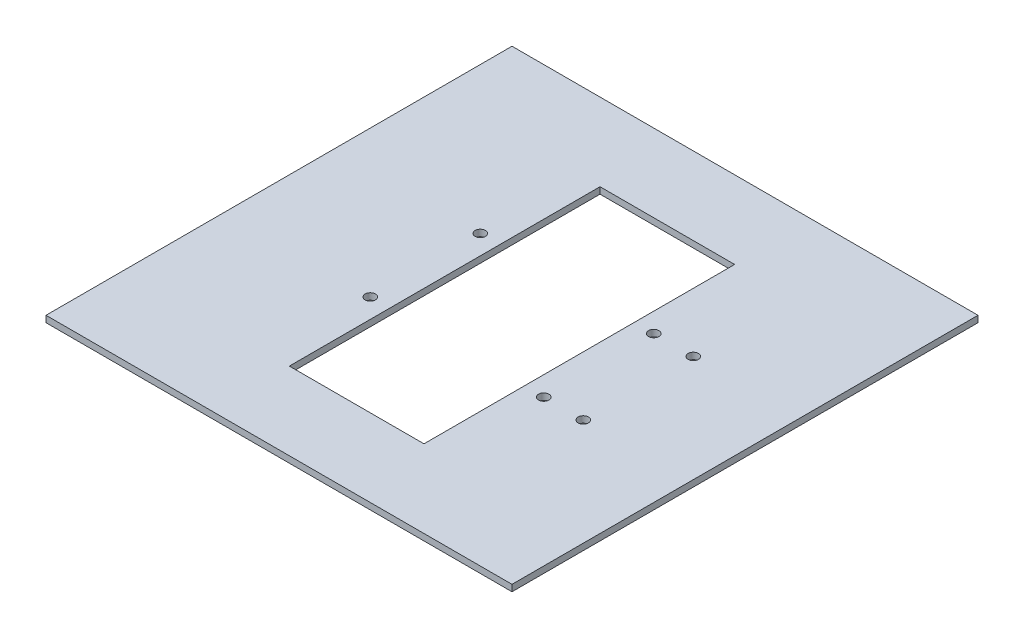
ISO-10303-21;
HEADER;
FILE_DESCRIPTION(('STEP AP214'),'2;1');
FILE_NAME('part.step','',(''),(''),'','','');
FILE_SCHEMA(('AUTOMOTIVE_DESIGN { 1 0 10303 214 1 1 1 1 }'));
ENDSEC;
DATA;
#1=APPLICATION_CONTEXT('core data for automotive mechanical design processes');
#2=APPLICATION_PROTOCOL_DEFINITION('international standard','automotive_design',2000,#1);
#3=PRODUCT_CONTEXT('',#1,'mechanical');
#4=PRODUCT('Part','Part','',(#3));
#5=PRODUCT_RELATED_PRODUCT_CATEGORY('part','',(#4));
#6=PRODUCT_DEFINITION_FORMATION('','',#4);
#7=PRODUCT_DEFINITION_CONTEXT('part definition',#1,'design');
#8=PRODUCT_DEFINITION('design','',#6,#7);
#9=PRODUCT_DEFINITION_SHAPE('','',#8);
#10=(LENGTH_UNIT() NAMED_UNIT(*) SI_UNIT(.MILLI.,.METRE.));
#11=(NAMED_UNIT(*) PLANE_ANGLE_UNIT() SI_UNIT($,.RADIAN.));
#12=(NAMED_UNIT(*) SI_UNIT($,.STERADIAN.) SOLID_ANGLE_UNIT());
#13=UNCERTAINTY_MEASURE_WITH_UNIT(LENGTH_MEASURE(1.E-05),#10,'distance_accuracy_value','');
#14=(GEOMETRIC_REPRESENTATION_CONTEXT(3) GLOBAL_UNCERTAINTY_ASSIGNED_CONTEXT((#13)) GLOBAL_UNIT_ASSIGNED_CONTEXT((#10,
#11,#12)) REPRESENTATION_CONTEXT('',''));
#15=CARTESIAN_POINT('',(0.,0.,0.));
#16=DIRECTION('',(0.,0.,1.));
#17=DIRECTION('',(1.,0.,0.));
#18=AXIS2_PLACEMENT_3D('',#15,#16,#17);
#19=CARTESIAN_POINT('',(114.3,1.5875,-114.3));
#20=DIRECTION('',(-1.,0.,0.));
#21=DIRECTION('',(0.,0.,1.));
#22=AXIS2_PLACEMENT_3D('',#19,#20,#21);
#23=PLANE('',#22);
#24=DIRECTION('',(0.,0.,-1.));
#25=VECTOR('',#24,1.);
#26=CARTESIAN_POINT('',(114.3,-1.5875,-114.3));
#27=LINE('',#26,#25);
#28=CARTESIAN_POINT('',(114.3,-1.5875,114.3));
#29=VERTEX_POINT('',#28);
#30=CARTESIAN_POINT('',(114.3,-1.5875,-114.3));
#31=VERTEX_POINT('',#30);
#32=EDGE_CURVE('E166',#29,#31,#27,.T.);
#33=ORIENTED_EDGE('',*,*,#32,.T.);
#34=DIRECTION('',(0.,-1.,0.));
#35=VECTOR('',#34,1.);
#36=CARTESIAN_POINT('',(114.3,1.5875,-114.3));
#37=LINE('',#36,#35);
#38=CARTESIAN_POINT('',(114.3,1.5875,-114.3));
#39=VERTEX_POINT('',#38);
#40=EDGE_CURVE('E11',#39,#31,#37,.T.);
#41=ORIENTED_EDGE('',*,*,#40,.F.);
#42=DIRECTION('',(0.,0.,-1.));
#43=VECTOR('',#42,1.);
#44=CARTESIAN_POINT('',(114.3,1.5875,-114.3));
#45=LINE('',#44,#43);
#46=CARTESIAN_POINT('',(114.3,1.5875,114.3));
#47=VERTEX_POINT('',#46);
#48=EDGE_CURVE('E169',#47,#39,#45,.T.);
#49=ORIENTED_EDGE('',*,*,#48,.F.);
#50=DIRECTION('',(0.,-1.,0.));
#51=VECTOR('',#50,1.);
#52=CARTESIAN_POINT('',(114.3,1.5875,114.3));
#53=LINE('',#52,#51);
#54=EDGE_CURVE('E179',#47,#29,#53,.T.);
#55=ORIENTED_EDGE('',*,*,#54,.T.);
#56=EDGE_LOOP('',(#33,#41,#49,#55));
#57=FACE_BOUND('',#56,.T.);
#58=ADVANCED_FACE('F32',(#57),#23,.F.);
#59=CARTESIAN_POINT('',(-114.3,1.5875,-114.3));
#60=DIRECTION('',(0.,0.,1.));
#61=DIRECTION('',(1.,0.,0.));
#62=AXIS2_PLACEMENT_3D('',#59,#60,#61);
#63=PLANE('',#62);
#64=DIRECTION('',(-1.,0.,0.));
#65=VECTOR('',#64,1.);
#66=CARTESIAN_POINT('',(-114.3,-1.5875,-114.3));
#67=LINE('',#66,#65);
#68=CARTESIAN_POINT('',(-114.3,-1.5875,-114.3));
#69=VERTEX_POINT('',#68);
#70=EDGE_CURVE('E182',#31,#69,#67,.T.);
#71=ORIENTED_EDGE('',*,*,#70,.T.);
#72=DIRECTION('',(0.,-1.,0.));
#73=VECTOR('',#72,1.);
#74=CARTESIAN_POINT('',(-114.3,1.5875,-114.3));
#75=LINE('',#74,#73);
#76=CARTESIAN_POINT('',(-114.3,1.5875,-114.3));
#77=VERTEX_POINT('',#76);
#78=EDGE_CURVE('E39',#77,#69,#75,.T.);
#79=ORIENTED_EDGE('',*,*,#78,.F.);
#80=DIRECTION('',(-1.,0.,0.));
#81=VECTOR('',#80,1.);
#82=CARTESIAN_POINT('',(-114.3,1.5875,-114.3));
#83=LINE('',#82,#81);
#84=EDGE_CURVE('E172',#39,#77,#83,.T.);
#85=ORIENTED_EDGE('',*,*,#84,.F.);
#86=ORIENTED_EDGE('',*,*,#40,.T.);
#87=EDGE_LOOP('',(#71,#79,#85,#86));
#88=FACE_BOUND('',#87,.T.);
#89=ADVANCED_FACE('F211',(#88),#63,.F.);
#90=CARTESIAN_POINT('',(-114.3,1.5875,-114.3));
#91=DIRECTION('',(1.,0.,0.));
#92=DIRECTION('',(0.,0.,-1.));
#93=AXIS2_PLACEMENT_3D('',#90,#91,#92);
#94=PLANE('',#93);
#95=DIRECTION('',(0.,0.,1.));
#96=VECTOR('',#95,1.);
#97=CARTESIAN_POINT('',(-114.3,-1.5875,-114.3));
#98=LINE('',#97,#96);
#99=CARTESIAN_POINT('',(-114.3,-1.5875,114.3));
#100=VERTEX_POINT('',#99);
#101=EDGE_CURVE('E184',#69,#100,#98,.T.);
#102=ORIENTED_EDGE('',*,*,#101,.T.);
#103=DIRECTION('',(0.,-1.,0.));
#104=VECTOR('',#103,1.);
#105=CARTESIAN_POINT('',(-114.3,1.5875,114.3));
#106=LINE('',#105,#104);
#107=CARTESIAN_POINT('',(-114.3,1.5875,114.3));
#108=VERTEX_POINT('',#107);
#109=EDGE_CURVE('E189',#108,#100,#106,.T.);
#110=ORIENTED_EDGE('',*,*,#109,.F.);
#111=DIRECTION('',(0.,0.,1.));
#112=VECTOR('',#111,1.);
#113=CARTESIAN_POINT('',(-114.3,1.5875,-114.3));
#114=LINE('',#113,#112);
#115=EDGE_CURVE('E175',#77,#108,#114,.T.);
#116=ORIENTED_EDGE('',*,*,#115,.F.);
#117=ORIENTED_EDGE('',*,*,#78,.T.);
#118=EDGE_LOOP('',(#102,#110,#116,#117));
#119=FACE_BOUND('',#118,.T.);
#120=ADVANCED_FACE('F196',(#119),#94,.F.);
#121=CARTESIAN_POINT('',(-114.3,1.5875,114.3));
#122=DIRECTION('',(0.,0.,-1.));
#123=DIRECTION('',(-1.,0.,0.));
#124=AXIS2_PLACEMENT_3D('',#121,#122,#123);
#125=PLANE('',#124);
#126=DIRECTION('',(1.,0.,0.));
#127=VECTOR('',#126,1.);
#128=CARTESIAN_POINT('',(-114.3,-1.5875,114.3));
#129=LINE('',#128,#127);
#130=EDGE_CURVE('E173',#100,#29,#129,.T.);
#131=ORIENTED_EDGE('',*,*,#130,.T.);
#132=ORIENTED_EDGE('',*,*,#54,.F.);
#133=DIRECTION('',(1.,0.,0.));
#134=VECTOR('',#133,1.);
#135=CARTESIAN_POINT('',(-114.3,1.5875,114.3));
#136=LINE('',#135,#134);
#137=EDGE_CURVE('E177',#108,#47,#136,.T.);
#138=ORIENTED_EDGE('',*,*,#137,.F.);
#139=ORIENTED_EDGE('',*,*,#109,.T.);
#140=EDGE_LOOP('',(#131,#132,#138,#139));
#141=FACE_BOUND('',#140,.T.);
#142=ADVANCED_FACE('F204',(#141),#125,.F.);
#143=CARTESIAN_POINT('',(114.3,1.5875,114.3));
#144=DIRECTION('',(0.,1.,0.));
#145=DIRECTION('',(0.,0.,1.));
#146=AXIS2_PLACEMENT_3D('',#143,#144,#145);
#147=PLANE('',#146);
#148=DIRECTION('',(0.,0.,-1.));
#149=VECTOR('',#148,1.);
#150=CARTESIAN_POINT('',(33.02,1.5875,-76.2));
#151=LINE('',#150,#149);
#152=CARTESIAN_POINT('',(33.02,1.5875,76.2));
#153=VERTEX_POINT('',#152);
#154=CARTESIAN_POINT('',(33.02,1.5875,-76.2));
#155=VERTEX_POINT('',#154);
#156=EDGE_CURVE('E46',#153,#155,#151,.T.);
#157=ORIENTED_EDGE('',*,*,#156,.F.);
#158=DIRECTION('',(1.,0.,0.));
#159=VECTOR('',#158,1.);
#160=CARTESIAN_POINT('',(-33.02,1.5875,76.2));
#161=LINE('',#160,#159);
#162=CARTESIAN_POINT('',(-33.02,1.5875,76.2));
#163=VERTEX_POINT('',#162);
#164=EDGE_CURVE('E114',#163,#153,#161,.T.);
#165=ORIENTED_EDGE('',*,*,#164,.F.);
#166=DIRECTION('',(0.,0.,1.));
#167=VECTOR('',#166,1.);
#168=CARTESIAN_POINT('',(-33.02,1.5875,-76.2));
#169=LINE('',#168,#167);
#170=CARTESIAN_POINT('',(-33.02,1.5875,-76.2));
#171=VERTEX_POINT('',#170);
#172=EDGE_CURVE('E117',#171,#163,#169,.T.);
#173=ORIENTED_EDGE('',*,*,#172,.F.);
#174=DIRECTION('',(-1.,0.,0.));
#175=VECTOR('',#174,1.);
#176=CARTESIAN_POINT('',(-33.02,1.5875,-76.2));
#177=LINE('',#176,#175);
#178=EDGE_CURVE('E123',#155,#171,#177,.T.);
#179=ORIENTED_EDGE('',*,*,#178,.F.);
#180=EDGE_LOOP('',(#157,#165,#173,#179));
#181=FACE_BOUND('',#180,.T.);
#182=CARTESIAN_POINT('',(-42.545,1.5875,26.9875));
#183=DIRECTION('',(0.,1.,0.));
#184=DIRECTION('',(0.,0.,1.));
#185=AXIS2_PLACEMENT_3D('',#182,#183,#184);
#186=CIRCLE('',#185,2.54);
#187=CARTESIAN_POINT('',(-42.545,1.5875,29.5275));
#188=VERTEX_POINT('',#187);
#189=EDGE_CURVE('E129',#188,#188,#186,.T.);
#190=ORIENTED_EDGE('',*,*,#189,.F.);
#191=EDGE_LOOP('',(#190));
#192=FACE_BOUND('',#191,.T.);
#193=CARTESIAN_POINT('',(42.545,1.5875,26.9875));
#194=DIRECTION('',(0.,1.,0.));
#195=DIRECTION('',(0.,0.,1.));
#196=AXIS2_PLACEMENT_3D('',#193,#194,#195);
#197=CIRCLE('',#196,2.54);
#198=CARTESIAN_POINT('',(42.545,1.5875,29.5275));
#199=VERTEX_POINT('',#198);
#200=EDGE_CURVE('E136',#199,#199,#197,.T.);
#201=ORIENTED_EDGE('',*,*,#200,.F.);
#202=EDGE_LOOP('',(#201));
#203=FACE_BOUND('',#202,.T.);
#204=CARTESIAN_POINT('',(61.9506,1.5875,26.9875));
#205=DIRECTION('',(0.,1.,0.));
#206=DIRECTION('',(0.,0.,1.));
#207=AXIS2_PLACEMENT_3D('',#204,#205,#206);
#208=CIRCLE('',#207,2.54);
#209=CARTESIAN_POINT('',(61.9506,1.5875,29.5275));
#210=VERTEX_POINT('',#209);
#211=EDGE_CURVE('E142',#210,#210,#208,.T.);
#212=ORIENTED_EDGE('',*,*,#211,.F.);
#213=EDGE_LOOP('',(#212));
#214=FACE_BOUND('',#213,.T.);
#215=CARTESIAN_POINT('',(61.9506,1.5875,-26.9875));
#216=DIRECTION('',(0.,1.,0.));
#217=DIRECTION('',(0.,0.,1.));
#218=AXIS2_PLACEMENT_3D('',#215,#216,#217);
#219=CIRCLE('',#218,2.54);
#220=CARTESIAN_POINT('',(61.9506,1.5875,-24.4475));
#221=VERTEX_POINT('',#220);
#222=EDGE_CURVE('E148',#221,#221,#219,.T.);
#223=ORIENTED_EDGE('',*,*,#222,.F.);
#224=EDGE_LOOP('',(#223));
#225=FACE_BOUND('',#224,.T.);
#226=CARTESIAN_POINT('',(42.545,1.5875,-26.9875));
#227=DIRECTION('',(0.,1.,0.));
#228=DIRECTION('',(0.,0.,1.));
#229=AXIS2_PLACEMENT_3D('',#226,#227,#228);
#230=CIRCLE('',#229,2.54);
#231=CARTESIAN_POINT('',(42.545,1.5875,-24.4475));
#232=VERTEX_POINT('',#231);
#233=EDGE_CURVE('E154',#232,#232,#230,.T.);
#234=ORIENTED_EDGE('',*,*,#233,.F.);
#235=EDGE_LOOP('',(#234));
#236=FACE_BOUND('',#235,.T.);
#237=CARTESIAN_POINT('',(-42.545,1.5875,-26.9875));
#238=DIRECTION('',(0.,1.,0.));
#239=DIRECTION('',(0.,0.,1.));
#240=AXIS2_PLACEMENT_3D('',#237,#238,#239);
#241=CIRCLE('',#240,2.54);
#242=CARTESIAN_POINT('',(-42.545,1.5875,-24.4475));
#243=VERTEX_POINT('',#242);
#244=EDGE_CURVE('E160',#243,#243,#241,.T.);
#245=ORIENTED_EDGE('',*,*,#244,.F.);
#246=EDGE_LOOP('',(#245));
#247=FACE_BOUND('',#246,.T.);
#248=ORIENTED_EDGE('',*,*,#48,.T.);
#249=ORIENTED_EDGE('',*,*,#84,.T.);
#250=ORIENTED_EDGE('',*,*,#115,.T.);
#251=ORIENTED_EDGE('',*,*,#137,.T.);
#252=EDGE_LOOP('',(#248,#249,#250,#251));
#253=FACE_BOUND('',#252,.T.);
#254=ADVANCED_FACE('F210',(#181,#192,#203,#214,#225,#236,#247,#253),#147,.T.);
#255=CARTESIAN_POINT('',(114.3,-1.5875,114.3));
#256=DIRECTION('',(0.,1.,0.));
#257=DIRECTION('',(0.,0.,1.));
#258=AXIS2_PLACEMENT_3D('',#255,#256,#257);
#259=PLANE('',#258);
#260=DIRECTION('',(1.,0.,0.));
#261=VECTOR('',#260,1.);
#262=CARTESIAN_POINT('',(-33.02,-1.5875,76.2));
#263=LINE('',#262,#261);
#264=CARTESIAN_POINT('',(-33.02,-1.5875,76.2));
#265=VERTEX_POINT('',#264);
#266=CARTESIAN_POINT('',(33.02,-1.5875,76.2));
#267=VERTEX_POINT('',#266);
#268=EDGE_CURVE('E104',#265,#267,#263,.T.);
#269=ORIENTED_EDGE('',*,*,#268,.T.);
#270=DIRECTION('',(0.,0.,-1.));
#271=VECTOR('',#270,1.);
#272=CARTESIAN_POINT('',(33.02,-1.5875,-76.2));
#273=LINE('',#272,#271);
#274=CARTESIAN_POINT('',(33.02,-1.5875,-76.2));
#275=VERTEX_POINT('',#274);
#276=EDGE_CURVE('E98',#267,#275,#273,.T.);
#277=ORIENTED_EDGE('',*,*,#276,.T.);
#278=DIRECTION('',(-1.,0.,0.));
#279=VECTOR('',#278,1.);
#280=CARTESIAN_POINT('',(-33.02,-1.5875,-76.2));
#281=LINE('',#280,#279);
#282=CARTESIAN_POINT('',(-33.02,-1.5875,-76.2));
#283=VERTEX_POINT('',#282);
#284=EDGE_CURVE('E107',#275,#283,#281,.T.);
#285=ORIENTED_EDGE('',*,*,#284,.T.);
#286=DIRECTION('',(0.,0.,1.));
#287=VECTOR('',#286,1.);
#288=CARTESIAN_POINT('',(-33.02,-1.5875,-76.2));
#289=LINE('',#288,#287);
#290=EDGE_CURVE('E54',#283,#265,#289,.T.);
#291=ORIENTED_EDGE('',*,*,#290,.T.);
#292=EDGE_LOOP('',(#269,#277,#285,#291));
#293=FACE_BOUND('',#292,.T.);
#294=CARTESIAN_POINT('',(-42.545,-1.5875,26.9875));
#295=DIRECTION('',(0.,1.,0.));
#296=DIRECTION('',(0.,0.,1.));
#297=AXIS2_PLACEMENT_3D('',#294,#295,#296);
#298=CIRCLE('',#297,2.54);
#299=CARTESIAN_POINT('',(-42.545,-1.5875,29.5275));
#300=VERTEX_POINT('',#299);
#301=EDGE_CURVE('E133',#300,#300,#298,.T.);
#302=ORIENTED_EDGE('',*,*,#301,.T.);
#303=EDGE_LOOP('',(#302));
#304=FACE_BOUND('',#303,.T.);
#305=CARTESIAN_POINT('',(42.545,-1.5875,26.9875));
#306=DIRECTION('',(0.,1.,0.));
#307=DIRECTION('',(0.,0.,1.));
#308=AXIS2_PLACEMENT_3D('',#305,#306,#307);
#309=CIRCLE('',#308,2.54);
#310=CARTESIAN_POINT('',(42.545,-1.5875,29.5275));
#311=VERTEX_POINT('',#310);
#312=EDGE_CURVE('E139',#311,#311,#309,.T.);
#313=ORIENTED_EDGE('',*,*,#312,.T.);
#314=EDGE_LOOP('',(#313));
#315=FACE_BOUND('',#314,.T.);
#316=CARTESIAN_POINT('',(61.9506,-1.5875,26.9875));
#317=DIRECTION('',(0.,1.,0.));
#318=DIRECTION('',(0.,0.,1.));
#319=AXIS2_PLACEMENT_3D('',#316,#317,#318);
#320=CIRCLE('',#319,2.54);
#321=CARTESIAN_POINT('',(61.9506,-1.5875,29.5275));
#322=VERTEX_POINT('',#321);
#323=EDGE_CURVE('E145',#322,#322,#320,.T.);
#324=ORIENTED_EDGE('',*,*,#323,.T.);
#325=EDGE_LOOP('',(#324));
#326=FACE_BOUND('',#325,.T.);
#327=CARTESIAN_POINT('',(61.9506,-1.5875,-26.9875));
#328=DIRECTION('',(0.,1.,0.));
#329=DIRECTION('',(0.,0.,1.));
#330=AXIS2_PLACEMENT_3D('',#327,#328,#329);
#331=CIRCLE('',#330,2.54);
#332=CARTESIAN_POINT('',(61.9506,-1.5875,-24.4475));
#333=VERTEX_POINT('',#332);
#334=EDGE_CURVE('E151',#333,#333,#331,.T.);
#335=ORIENTED_EDGE('',*,*,#334,.T.);
#336=EDGE_LOOP('',(#335));
#337=FACE_BOUND('',#336,.T.);
#338=CARTESIAN_POINT('',(42.545,-1.5875,-26.9875));
#339=DIRECTION('',(0.,1.,0.));
#340=DIRECTION('',(0.,0.,1.));
#341=AXIS2_PLACEMENT_3D('',#338,#339,#340);
#342=CIRCLE('',#341,2.54);
#343=CARTESIAN_POINT('',(42.545,-1.5875,-24.4475));
#344=VERTEX_POINT('',#343);
#345=EDGE_CURVE('E157',#344,#344,#342,.T.);
#346=ORIENTED_EDGE('',*,*,#345,.T.);
#347=EDGE_LOOP('',(#346));
#348=FACE_BOUND('',#347,.T.);
#349=CARTESIAN_POINT('',(-42.545,-1.5875,-26.9875));
#350=DIRECTION('',(0.,1.,0.));
#351=DIRECTION('',(0.,0.,1.));
#352=AXIS2_PLACEMENT_3D('',#349,#350,#351);
#353=CIRCLE('',#352,2.54);
#354=CARTESIAN_POINT('',(-42.545,-1.5875,-24.4475));
#355=VERTEX_POINT('',#354);
#356=EDGE_CURVE('E163',#355,#355,#353,.T.);
#357=ORIENTED_EDGE('',*,*,#356,.T.);
#358=EDGE_LOOP('',(#357));
#359=FACE_BOUND('',#358,.T.);
#360=ORIENTED_EDGE('',*,*,#32,.F.);
#361=ORIENTED_EDGE('',*,*,#130,.F.);
#362=ORIENTED_EDGE('',*,*,#101,.F.);
#363=ORIENTED_EDGE('',*,*,#70,.F.);
#364=EDGE_LOOP('',(#360,#361,#362,#363));
#365=FACE_BOUND('',#364,.T.);
#366=ADVANCED_FACE('F111',(#293,#304,#315,#326,#337,#348,#359,#365),#259,.F.);
#367=CARTESIAN_POINT('',(-42.545,-1.5875,-26.9875));
#368=DIRECTION('',(0.,1.,0.));
#369=DIRECTION('',(0.,0.,1.));
#370=AXIS2_PLACEMENT_3D('',#367,#368,#369);
#371=CYLINDRICAL_SURFACE('',#370,2.54);
#372=ORIENTED_EDGE('',*,*,#356,.F.);
#373=EDGE_LOOP('',(#372));
#374=FACE_BOUND('',#373,.T.);
#375=ORIENTED_EDGE('',*,*,#244,.T.);
#376=EDGE_LOOP('',(#375));
#377=FACE_BOUND('',#376,.T.);
#378=ADVANCED_FACE('F223',(#374,#377),#371,.F.);
#379=CARTESIAN_POINT('',(42.545,-1.5875,-26.9875));
#380=DIRECTION('',(0.,1.,0.));
#381=DIRECTION('',(0.,0.,1.));
#382=AXIS2_PLACEMENT_3D('',#379,#380,#381);
#383=CYLINDRICAL_SURFACE('',#382,2.54);
#384=ORIENTED_EDGE('',*,*,#345,.F.);
#385=EDGE_LOOP('',(#384));
#386=FACE_BOUND('',#385,.T.);
#387=ORIENTED_EDGE('',*,*,#233,.T.);
#388=EDGE_LOOP('',(#387));
#389=FACE_BOUND('',#388,.T.);
#390=ADVANCED_FACE('F229',(#386,#389),#383,.F.);
#391=CARTESIAN_POINT('',(61.9506,-1.5875,-26.9875));
#392=DIRECTION('',(0.,1.,0.));
#393=DIRECTION('',(0.,0.,1.));
#394=AXIS2_PLACEMENT_3D('',#391,#392,#393);
#395=CYLINDRICAL_SURFACE('',#394,2.54);
#396=ORIENTED_EDGE('',*,*,#334,.F.);
#397=EDGE_LOOP('',(#396));
#398=FACE_BOUND('',#397,.T.);
#399=ORIENTED_EDGE('',*,*,#222,.T.);
#400=EDGE_LOOP('',(#399));
#401=FACE_BOUND('',#400,.T.);
#402=ADVANCED_FACE('F233',(#398,#401),#395,.F.);
#403=CARTESIAN_POINT('',(61.9506,-1.5875,26.9875));
#404=DIRECTION('',(0.,1.,0.));
#405=DIRECTION('',(0.,0.,1.));
#406=AXIS2_PLACEMENT_3D('',#403,#404,#405);
#407=CYLINDRICAL_SURFACE('',#406,2.54);
#408=ORIENTED_EDGE('',*,*,#323,.F.);
#409=EDGE_LOOP('',(#408));
#410=FACE_BOUND('',#409,.T.);
#411=ORIENTED_EDGE('',*,*,#211,.T.);
#412=EDGE_LOOP('',(#411));
#413=FACE_BOUND('',#412,.T.);
#414=ADVANCED_FACE('F237',(#410,#413),#407,.F.);
#415=CARTESIAN_POINT('',(42.545,-1.5875,26.9875));
#416=DIRECTION('',(0.,1.,0.));
#417=DIRECTION('',(0.,0.,1.));
#418=AXIS2_PLACEMENT_3D('',#415,#416,#417);
#419=CYLINDRICAL_SURFACE('',#418,2.54);
#420=ORIENTED_EDGE('',*,*,#312,.F.);
#421=EDGE_LOOP('',(#420));
#422=FACE_BOUND('',#421,.T.);
#423=ORIENTED_EDGE('',*,*,#200,.T.);
#424=EDGE_LOOP('',(#423));
#425=FACE_BOUND('',#424,.T.);
#426=ADVANCED_FACE('F241',(#422,#425),#419,.F.);
#427=CARTESIAN_POINT('',(-42.545,-1.5875,26.9875));
#428=DIRECTION('',(0.,1.,0.));
#429=DIRECTION('',(0.,0.,1.));
#430=AXIS2_PLACEMENT_3D('',#427,#428,#429);
#431=CYLINDRICAL_SURFACE('',#430,2.54);
#432=ORIENTED_EDGE('',*,*,#301,.F.);
#433=EDGE_LOOP('',(#432));
#434=FACE_BOUND('',#433,.T.);
#435=ORIENTED_EDGE('',*,*,#189,.T.);
#436=EDGE_LOOP('',(#435));
#437=FACE_BOUND('',#436,.T.);
#438=ADVANCED_FACE('F245',(#434,#437),#431,.F.);
#439=CARTESIAN_POINT('',(33.02,-1.5875,-76.2));
#440=DIRECTION('',(1.,0.,0.));
#441=DIRECTION('',(0.,0.,-1.));
#442=AXIS2_PLACEMENT_3D('',#439,#440,#441);
#443=PLANE('',#442);
#444=ORIENTED_EDGE('',*,*,#156,.T.);
#445=DIRECTION('',(0.,1.,0.));
#446=VECTOR('',#445,1.);
#447=CARTESIAN_POINT('',(33.02,-1.5875,-76.2));
#448=LINE('',#447,#446);
#449=EDGE_CURVE('E94',#275,#155,#448,.T.);
#450=ORIENTED_EDGE('',*,*,#449,.F.);
#451=ORIENTED_EDGE('',*,*,#276,.F.);
#452=DIRECTION('',(0.,1.,0.));
#453=VECTOR('',#452,1.);
#454=CARTESIAN_POINT('',(33.02,-1.5875,76.2));
#455=LINE('',#454,#453);
#456=EDGE_CURVE('E127',#267,#153,#455,.T.);
#457=ORIENTED_EDGE('',*,*,#456,.T.);
#458=EDGE_LOOP('',(#444,#450,#451,#457));
#459=FACE_BOUND('',#458,.T.);
#460=ADVANCED_FACE('F96',(#459),#443,.F.);
#461=CARTESIAN_POINT('',(-33.02,-1.5875,76.2));
#462=DIRECTION('',(0.,0.,1.));
#463=DIRECTION('',(1.,0.,0.));
#464=AXIS2_PLACEMENT_3D('',#461,#462,#463);
#465=PLANE('',#464);
#466=ORIENTED_EDGE('',*,*,#164,.T.);
#467=ORIENTED_EDGE('',*,*,#456,.F.);
#468=ORIENTED_EDGE('',*,*,#268,.F.);
#469=DIRECTION('',(0.,1.,0.));
#470=VECTOR('',#469,1.);
#471=CARTESIAN_POINT('',(-33.02,-1.5875,76.2));
#472=LINE('',#471,#470);
#473=EDGE_CURVE('E130',#265,#163,#472,.T.);
#474=ORIENTED_EDGE('',*,*,#473,.T.);
#475=EDGE_LOOP('',(#466,#467,#468,#474));
#476=FACE_BOUND('',#475,.T.);
#477=ADVANCED_FACE('F252',(#476),#465,.F.);
#478=CARTESIAN_POINT('',(-33.02,-1.5875,-76.2));
#479=DIRECTION('',(-1.,0.,0.));
#480=DIRECTION('',(0.,0.,1.));
#481=AXIS2_PLACEMENT_3D('',#478,#479,#480);
#482=PLANE('',#481);
#483=ORIENTED_EDGE('',*,*,#172,.T.);
#484=ORIENTED_EDGE('',*,*,#473,.F.);
#485=ORIENTED_EDGE('',*,*,#290,.F.);
#486=DIRECTION('',(0.,1.,0.));
#487=VECTOR('',#486,1.);
#488=CARTESIAN_POINT('',(-33.02,-1.5875,-76.2));
#489=LINE('',#488,#487);
#490=EDGE_CURVE('E103',#283,#171,#489,.T.);
#491=ORIENTED_EDGE('',*,*,#490,.T.);
#492=EDGE_LOOP('',(#483,#484,#485,#491));
#493=FACE_BOUND('',#492,.T.);
#494=ADVANCED_FACE('F255',(#493),#482,.F.);
#495=CARTESIAN_POINT('',(-33.02,-1.5875,-76.2));
#496=DIRECTION('',(0.,0.,-1.));
#497=DIRECTION('',(-1.,0.,0.));
#498=AXIS2_PLACEMENT_3D('',#495,#496,#497);
#499=PLANE('',#498);
#500=ORIENTED_EDGE('',*,*,#178,.T.);
#501=ORIENTED_EDGE('',*,*,#490,.F.);
#502=ORIENTED_EDGE('',*,*,#284,.F.);
#503=ORIENTED_EDGE('',*,*,#449,.T.);
#504=EDGE_LOOP('',(#500,#501,#502,#503));
#505=FACE_BOUND('',#504,.T.);
#506=ADVANCED_FACE('F108',(#505),#499,.F.);
#507=CLOSED_SHELL('',(#58,#89,#120,#142,#254,#366,#378,#390,#402,#414,#426,#438,#460,#477,#494,#506));
#508=MANIFOLD_SOLID_BREP('B2',#507);
#509=ADVANCED_BREP_SHAPE_REPRESENTATION('',(#18,#508),#14);
#510=SHAPE_DEFINITION_REPRESENTATION(#9,#509);
ENDSEC;
END-ISO-10303-21;
